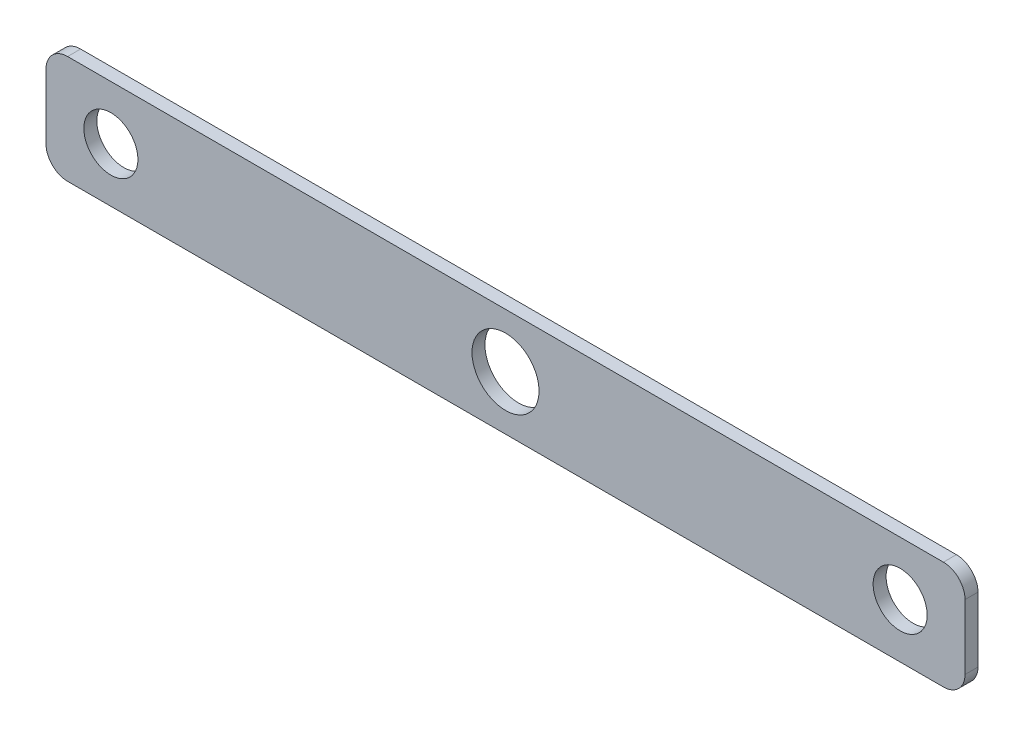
from build123d import *

# Parameters (mm, degrees)
SKETCH1_W      = 215.9
SKETCH1_H      = 25.4
SKETCH1_R      = 6.35
SKETCH1_R_2    = 7.874
EXTRUDE1_DEPTH = 1.524
FILLET1_R      = 5.08


with BuildPart() as part:
    # Sketch1 → Extrude1 (new, symmetric)
    with BuildSketch(Plane.XY):
        Rectangle(SKETCH1_W, SKETCH1_H)
        with Locations(Location((92.71, 0, 0), (0, 0, 180))):
            Circle(SKETCH1_R, mode=Mode.SUBTRACT)
        with Locations(Location((0, 0, 0), (0, 0, 180))):
            Circle(SKETCH1_R_2, mode=Mode.SUBTRACT)
        with Locations(Location((-92.71, 0, 0), (0, 0, 180))):
            Circle(SKETCH1_R, mode=Mode.SUBTRACT)
    extrude(amount=EXTRUDE1_DEPTH, both=True)

    # Fillet1
    fillet1_edges = [part.edges().sort_by_distance(p)[0] for p in [
        (-107.95, 12.7, 0),
        (107.95, 12.7, 0),
        (107.95, -12.7, 0),
        (-107.95, -12.7, 0),
    ]]
    fillet(fillet1_edges, radius=FILLET1_R)


solid = part.part
